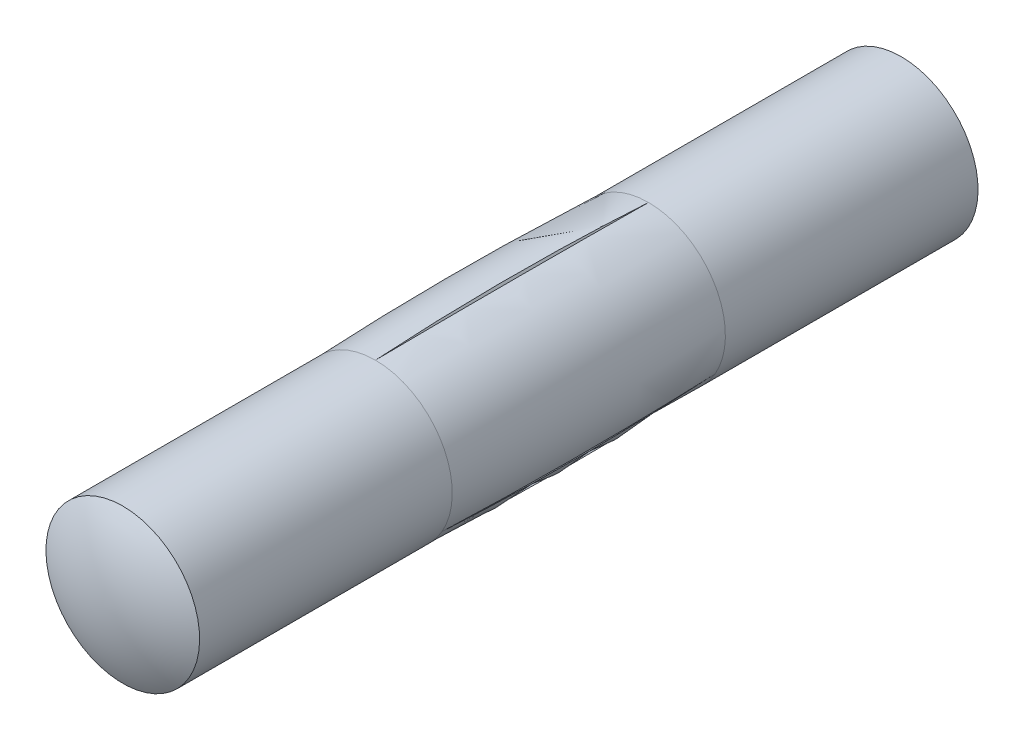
ISO-10303-21;
HEADER;
FILE_DESCRIPTION(('STEP AP214'),'2;1');
FILE_NAME('part.step','',(''),(''),'','','');
FILE_SCHEMA(('AUTOMOTIVE_DESIGN { 1 0 10303 214 1 1 1 1 }'));
ENDSEC;
DATA;
#1=APPLICATION_CONTEXT('core data for automotive mechanical design processes');
#2=APPLICATION_PROTOCOL_DEFINITION('international standard','automotive_design',2000,#1);
#3=PRODUCT_CONTEXT('',#1,'mechanical');
#4=PRODUCT('Part','Part','',(#3));
#5=PRODUCT_RELATED_PRODUCT_CATEGORY('part','',(#4));
#6=PRODUCT_DEFINITION_FORMATION('','',#4);
#7=PRODUCT_DEFINITION_CONTEXT('part definition',#1,'design');
#8=PRODUCT_DEFINITION('design','',#6,#7);
#9=PRODUCT_DEFINITION_SHAPE('','',#8);
#10=(LENGTH_UNIT() NAMED_UNIT(*) SI_UNIT(.MILLI.,.METRE.));
#11=(NAMED_UNIT(*) PLANE_ANGLE_UNIT() SI_UNIT($,.RADIAN.));
#12=(NAMED_UNIT(*) SI_UNIT($,.STERADIAN.) SOLID_ANGLE_UNIT());
#13=UNCERTAINTY_MEASURE_WITH_UNIT(LENGTH_MEASURE(1.E-05),#10,'distance_accuracy_value','');
#14=(GEOMETRIC_REPRESENTATION_CONTEXT(3) GLOBAL_UNCERTAINTY_ASSIGNED_CONTEXT((#13)) GLOBAL_UNIT_ASSIGNED_CONTEXT((#10,
#11,#12)) REPRESENTATION_CONTEXT('',''));
#15=CARTESIAN_POINT('',(0.,0.,0.));
#16=DIRECTION('',(0.,0.,1.));
#17=DIRECTION('',(1.,0.,0.));
#18=AXIS2_PLACEMENT_3D('',#15,#16,#17);
#19=CARTESIAN_POINT('',(0.,0.,12.9875));
#20=DIRECTION('',(-1.,0.,0.));
#21=DIRECTION('',(0.,0.,1.));
#22=AXIS2_PLACEMENT_3D('',#19,#20,#21);
#23=SPHERICAL_SURFACE('',#22,3.0125);
#24=CARTESIAN_POINT('',(0.,0.,12.9875));
#25=DIRECTION('',(0.,0.,1.));
#26=DIRECTION('',(0.,1.,0.));
#27=AXIS2_PLACEMENT_3D('',#24,#25,#26);
#28=SPHERICAL_SURFACE('',#27,3.0125);
#29=CARTESIAN_POINT('',(0.,0.,15.6));
#30=DIRECTION('',(0.,0.,1.));
#31=DIRECTION('',(0.,1.,0.));
#32=AXIS2_PLACEMENT_3D('',#29,#30,#31);
#33=CIRCLE('',#32,1.5);
#34=CARTESIAN_POINT('',(0.,1.5,15.6));
#35=VERTEX_POINT('',#34);
#36=EDGE_CURVE('E11',#35,#35,#33,.T.);
#37=ORIENTED_EDGE('',*,*,#36,.T.);
#38=EDGE_LOOP('',(#37));
#39=FACE_BOUND('',#38,.T.);
#40=ADVANCED_FACE('F17',(#39),#28,.T.);
#41=CARTESIAN_POINT('',(0.,0.,13.1333333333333));
#42=DIRECTION('',(0.,0.,-1.));
#43=DIRECTION('',(0.,1.,0.));
#44=AXIS2_PLACEMENT_3D('',#41,#42,#43);
#45=CYLINDRICAL_SURFACE('',#44,1.5);
#46=ORIENTED_EDGE('',*,*,#36,.F.);
#47=EDGE_LOOP('',(#46));
#48=FACE_BOUND('',#47,.T.);
#49=CARTESIAN_POINT('',(0.,0.,10.6666666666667));
#50=DIRECTION('',(0.,0.,1.));
#51=DIRECTION('',(0.,1.,0.));
#52=AXIS2_PLACEMENT_3D('',#49,#50,#51);
#53=CIRCLE('',#52,1.5);
#54=CARTESIAN_POINT('',(-1.29903810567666,-0.75,10.6666666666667));
#55=VERTEX_POINT('',#54);
#56=CARTESIAN_POINT('',(1.29903810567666,-0.75,10.6666666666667));
#57=VERTEX_POINT('',#56);
#58=EDGE_CURVE('E102',#55,#57,#53,.T.);
#59=ORIENTED_EDGE('',*,*,#58,.T.);
#60=CARTESIAN_POINT('',(0.,0.,10.6666666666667));
#61=DIRECTION('',(0.,0.,1.));
#62=DIRECTION('',(0.,1.,0.));
#63=AXIS2_PLACEMENT_3D('',#60,#61,#62);
#64=CIRCLE('',#63,1.5);
#65=CARTESIAN_POINT('',(0.,1.5,10.6666666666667));
#66=VERTEX_POINT('',#65);
#67=EDGE_CURVE('E157',#57,#66,#64,.T.);
#68=ORIENTED_EDGE('',*,*,#67,.T.);
#69=CARTESIAN_POINT('',(0.,0.,10.6666666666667));
#70=DIRECTION('',(0.,0.,1.));
#71=DIRECTION('',(0.,1.,0.));
#72=AXIS2_PLACEMENT_3D('',#69,#70,#71);
#73=CIRCLE('',#72,1.5);
#74=EDGE_CURVE('E55',#66,#55,#73,.T.);
#75=ORIENTED_EDGE('',*,*,#74,.T.);
#76=EDGE_LOOP('',(#59,#68,#75));
#77=FACE_BOUND('',#76,.T.);
#78=ADVANCED_FACE('F183',(#48,#77),#45,.T.);
#79=CARTESIAN_POINT('',(0.,0.,2.86666666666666));
#80=DIRECTION('',(0.,0.,-1.));
#81=DIRECTION('',(0.,1.,0.));
#82=AXIS2_PLACEMENT_3D('',#79,#80,#81);
#83=CYLINDRICAL_SURFACE('',#82,1.5);
#84=CARTESIAN_POINT('',(0.,0.,5.33333333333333));
#85=DIRECTION('',(0.,0.,1.));
#86=DIRECTION('',(0.,1.,0.));
#87=AXIS2_PLACEMENT_3D('',#84,#85,#86);
#88=CIRCLE('',#87,1.5);
#89=CARTESIAN_POINT('',(0.,1.5,5.33333333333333));
#90=VERTEX_POINT('',#89);
#91=CARTESIAN_POINT('',(-1.29903810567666,-0.75,5.3333333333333));
#92=VERTEX_POINT('',#91);
#93=EDGE_CURVE('E62',#90,#92,#88,.T.);
#94=ORIENTED_EDGE('',*,*,#93,.F.);
#95=CARTESIAN_POINT('',(0.,0.,5.33333333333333));
#96=DIRECTION('',(0.,0.,1.));
#97=DIRECTION('',(0.,1.,0.));
#98=AXIS2_PLACEMENT_3D('',#95,#96,#97);
#99=CIRCLE('',#98,1.5);
#100=CARTESIAN_POINT('',(1.29903810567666,-0.75,5.3333333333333));
#101=VERTEX_POINT('',#100);
#102=EDGE_CURVE('E95',#101,#90,#99,.T.);
#103=ORIENTED_EDGE('',*,*,#102,.F.);
#104=CARTESIAN_POINT('',(0.,0.,5.33333333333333));
#105=DIRECTION('',(0.,0.,1.));
#106=DIRECTION('',(0.,1.,0.));
#107=AXIS2_PLACEMENT_3D('',#104,#105,#106);
#108=CIRCLE('',#107,1.5);
#109=EDGE_CURVE('E89',#92,#101,#108,.T.);
#110=ORIENTED_EDGE('',*,*,#109,.F.);
#111=EDGE_LOOP('',(#94,#103,#110));
#112=FACE_BOUND('',#111,.T.);
#113=CARTESIAN_POINT('',(0.,0.,0.4));
#114=DIRECTION('',(0.,0.,1.));
#115=DIRECTION('',(0.,1.,0.));
#116=AXIS2_PLACEMENT_3D('',#113,#114,#115);
#117=CIRCLE('',#116,1.5);
#118=CARTESIAN_POINT('',(0.,1.5,0.4));
#119=VERTEX_POINT('',#118);
#120=EDGE_CURVE('E30',#119,#119,#117,.T.);
#121=ORIENTED_EDGE('',*,*,#120,.T.);
#122=EDGE_LOOP('',(#121));
#123=FACE_BOUND('',#122,.T.);
#124=ADVANCED_FACE('F92',(#112,#123),#83,.T.);
#125=CARTESIAN_POINT('',(0.,0.,3.0125));
#126=DIRECTION('',(-1.,0.,0.));
#127=DIRECTION('',(0.,0.,1.));
#128=AXIS2_PLACEMENT_3D('',#125,#126,#127);
#129=SPHERICAL_SURFACE('',#128,3.0125);
#130=CARTESIAN_POINT('',(0.,0.,3.0125));
#131=DIRECTION('',(0.,0.,1.));
#132=DIRECTION('',(0.,1.,0.));
#133=AXIS2_PLACEMENT_3D('',#130,#131,#132);
#134=SPHERICAL_SURFACE('',#133,3.0125);
#135=ORIENTED_EDGE('',*,*,#120,.F.);
#136=EDGE_LOOP('',(#135));
#137=FACE_BOUND('',#136,.T.);
#138=ADVANCED_FACE('F215',(#137),#134,.T.);
#139=CARTESIAN_POINT('',(0.86036465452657,2.72872806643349,8.4));
#140=DIRECTION('',(-0.819152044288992,0.573576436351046,0.));
#141=DIRECTION('',(0.,0.,1.));
#142=AXIS2_PLACEMENT_3D('',#139,#140,#141);
#143=PLANE('',#142);
#144=CARTESIAN_POINT('',(-6.89647088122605E-05,1.50000006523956,5.33333511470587));
#145=CARTESIAN_POINT('',(0.00559862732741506,1.50812433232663,5.54995931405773));
#146=CARTESIAN_POINT('',(0.0105847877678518,1.51523141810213,5.766639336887));
#147=CARTESIAN_POINT('',(0.0192447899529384,1.52754394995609,6.20370739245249));
#148=CARTESIAN_POINT('',(0.0228952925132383,1.53271560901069,6.42409684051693));
#149=CARTESIAN_POINT('',(0.0287913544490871,1.54108827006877,6.86856748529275));
#150=CARTESIAN_POINT('',(0.0310127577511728,1.54425537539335,7.09264964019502));
#151=CARTESIAN_POINT('',(0.0339980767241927,1.54853371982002,7.5444875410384));
#152=CARTESIAN_POINT('',(0.03473770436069,1.54961069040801,7.7722437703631));
#153=CARTESIAN_POINT('',(0.0347378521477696,1.54961068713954,8.22775052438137));
#154=CARTESIAN_POINT('',(0.0339984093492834,1.54853376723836,8.45550104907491));
#155=CARTESIAN_POINT('',(0.0310133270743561,1.54425560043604,8.90733134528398));
#156=CARTESIAN_POINT('',(0.0287919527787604,1.54108858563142,9.13141159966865));
#157=CARTESIAN_POINT('',(0.0228958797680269,1.5327160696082,9.57588224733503));
#158=CARTESIAN_POINT('',(0.0192453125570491,1.52754442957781,9.79627359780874));
#159=CARTESIAN_POINT('',(0.0105851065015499,1.51523179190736,10.2333492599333));
#160=CARTESIAN_POINT('',(0.00559878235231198,1.50812454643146,10.4500349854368));
#161=CARTESIAN_POINT('',(-6.8964708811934E-05,1.50000006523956,10.6666648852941));
#162=B_SPLINE_CURVE_WITH_KNOTS('',3,(#144,#145,#146,#147,#148,#149,#150,#151,#152,#153,#154,
#155,#156,#157,#158,#159,#160,#161),.UNSPECIFIED.,.F.,.F.,(4,2,2,2,2,2,2,2,4),(0.,
0.650548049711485,1.31197471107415,1.98430652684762,2.66757132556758,3.35081900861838,
4.02314511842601,4.68457748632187,5.33514265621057),.UNSPECIFIED.);
#163=EDGE_CURVE('E154',#90,#66,#162,.T.);
#164=ORIENTED_EDGE('',*,*,#163,.F.);
#165=DIRECTION('',(0.,0.,1.));
#166=VECTOR('',#165,1.);
#167=CARTESIAN_POINT('',(0.,1.5,0.4));
#168=LINE('',#167,#166);
#169=EDGE_CURVE('E76',#90,#66,#168,.T.);
#170=ORIENTED_EDGE('',*,*,#169,.T.);
#171=EDGE_LOOP('',(#164,#170));
#172=FACE_BOUND('',#171,.T.);
#173=ADVANCED_FACE('F181',(#172),#143,.T.);
#174=CARTESIAN_POINT('',(-0.860364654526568,2.72872806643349,8.4));
#175=DIRECTION('',(-0.819152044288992,-0.573576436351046,0.));
#176=DIRECTION('',(0.,0.,1.));
#177=AXIS2_PLACEMENT_3D('',#174,#175,#176);
#178=PLANE('',#177);
#179=CARTESIAN_POINT('',(6.89647088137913E-05,1.50000006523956,10.6666648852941));
#180=CARTESIAN_POINT('',(-0.00559862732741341,1.50812433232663,10.4500406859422));
#181=CARTESIAN_POINT('',(-0.0105847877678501,1.51523141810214,10.2333606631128));
#182=CARTESIAN_POINT('',(-0.0192447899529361,1.5275439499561,9.79629260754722));
#183=CARTESIAN_POINT('',(-0.022895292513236,1.53271560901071,9.57590315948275));
#184=CARTESIAN_POINT('',(-0.0287913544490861,1.54108827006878,9.13143251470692));
#185=CARTESIAN_POINT('',(-0.0310127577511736,1.54425537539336,8.90735035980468));
#186=CARTESIAN_POINT('',(-0.0339980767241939,1.54853371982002,8.45551245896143));
#187=CARTESIAN_POINT('',(-0.0347377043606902,1.54961069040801,8.22775622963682));
#188=CARTESIAN_POINT('',(-0.0347378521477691,1.54961068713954,7.77224947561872));
#189=CARTESIAN_POINT('',(-0.0339984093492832,1.54853376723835,7.54449895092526));
#190=CARTESIAN_POINT('',(-0.0310133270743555,1.54425560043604,7.09266865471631));
#191=CARTESIAN_POINT('',(-0.0287919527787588,1.54108858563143,6.86858840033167));
#192=CARTESIAN_POINT('',(-0.0228958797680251,1.53271606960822,6.42411775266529));
#193=CARTESIAN_POINT('',(-0.019245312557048,1.52754442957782,6.20372640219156));
#194=CARTESIAN_POINT('',(-0.0105851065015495,1.51523179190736,5.76665074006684));
#195=CARTESIAN_POINT('',(-0.00559878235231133,1.50812454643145,5.5499650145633));
#196=CARTESIAN_POINT('',(6.89647088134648E-05,1.50000006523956,5.33333511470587));
#197=B_SPLINE_CURVE_WITH_KNOTS('',3,(#179,#180,#181,#182,#183,#184,#185,#186,#187,#188,#189,
#190,#191,#192,#193,#194,#195,#196),.UNSPECIFIED.,.F.,.F.,(4,2,2,2,2,2,2,2,4),(0.,
0.650548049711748,1.3119747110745,1.98430652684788,2.66757132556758,3.35081900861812,
4.02314511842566,4.68457748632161,5.33514265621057),.UNSPECIFIED.);
#198=EDGE_CURVE('E70',#66,#90,#197,.T.);
#199=ORIENTED_EDGE('',*,*,#198,.F.);
#200=ORIENTED_EDGE('',*,*,#169,.F.);
#201=EDGE_LOOP('',(#199,#200));
#202=FACE_BOUND('',#201,.T.);
#203=ADVANCED_FACE('F19',(#202),#178,.F.);
#204=CARTESIAN_POINT('',(0.,0.,8.));
#205=DIRECTION('',(0.,0.,1.));
#206=DIRECTION('',(-1.,0.,0.));
#207=AXIS2_PLACEMENT_3D('',#204,#205,#206);
#208=DEGENERATE_TOROIDAL_SURFACE('',#207,69.5861111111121,71.1361111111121,.F.);
#209=CARTESIAN_POINT('',(-1.29900367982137,-0.750059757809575,5.33333511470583));
#210=CARTESIAN_POINT('',(-1.30887329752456,-0.749213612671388,5.54995931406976));
#211=CARTESIAN_POINT('',(-1.31752129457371,-0.748449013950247,5.76663933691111));
#212=CARTESIAN_POINT('',(-1.3325142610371,-0.747105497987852,6.2037073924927));
#213=CARTESIAN_POINT('',(-1.33881830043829,-0.74652989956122,6.42409684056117));
#214=CARTESIAN_POINT('',(-1.34901726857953,-0.745610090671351,6.868567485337));
#215=CARTESIAN_POINT('',(-1.35287076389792,-0.745269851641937,7.09264964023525));
#216=CARTESIAN_POINT('',(-1.35806857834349,-0.744823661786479,7.54448754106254));
#217=CARTESIAN_POINT('',(-1.35937107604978,-0.744721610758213,7.77224377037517));
#218=CARTESIAN_POINT('',(-1.35937114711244,-0.744721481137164,8.22775052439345));
#219=CARTESIAN_POINT('',(-1.35806878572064,-0.744823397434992,8.45550104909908));
#220=CARTESIAN_POINT('',(-1.35287124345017,-0.745269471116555,8.90733134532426));
#221=CARTESIAN_POINT('',(-1.34901784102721,-0.745609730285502,9.13141159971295));
#222=CARTESIAN_POINT('',(-1.33881899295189,-0.746529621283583,9.57588224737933));
#223=CARTESIAN_POINT('',(-1.33251493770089,-0.747105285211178,9.79627359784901));
#224=CARTESIAN_POINT('',(-1.31752177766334,-0.748448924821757,10.2333492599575));
#225=CARTESIAN_POINT('',(-1.30887356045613,-0.749213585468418,10.4500349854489));
#226=CARTESIAN_POINT('',(-1.29900367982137,-0.750059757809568,10.6666648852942));
#227=B_SPLINE_CURVE_WITH_KNOTS('',3,(#209,#210,#211,#212,#213,#214,#215,#216,#217,#218,#219,
#220,#221,#222,#223,#224,#225,#226),.UNSPECIFIED.,.F.,.F.,(4,2,2,2,2,2,2,2,4),(0.,
0.65054804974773,1.31197471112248,1.98430652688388,2.66757132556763,3.35081900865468,
4.0231451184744,4.68457748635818,5.33514265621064),.UNSPECIFIED.);
#228=EDGE_CURVE('E66',#92,#55,#227,.T.);
#229=ORIENTED_EDGE('',*,*,#228,.T.);
#230=ORIENTED_EDGE('',*,*,#74,.F.);
#231=ORIENTED_EDGE('',*,*,#198,.T.);
#232=ORIENTED_EDGE('',*,*,#93,.T.);
#233=EDGE_LOOP('',(#229,#230,#231,#232));
#234=FACE_BOUND('',#233,.T.);
#235=ADVANCED_FACE('F64',(#234),#208,.F.);
#236=CARTESIAN_POINT('',(-1.9329654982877,-2.10946168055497,8.4));
#237=DIRECTION('',(0.90630778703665,-0.4226182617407,0.));
#238=DIRECTION('',(0.,0.,1.));
#239=AXIS2_PLACEMENT_3D('',#236,#237,#238);
#240=PLANE('',#239);
#241=CARTESIAN_POINT('',(-1.29907264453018,-0.749940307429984,10.6666648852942));
#242=CARTESIAN_POINT('',(-1.30327467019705,-0.758910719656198,10.4500406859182));
#243=CARTESIAN_POINT('',(-1.30693650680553,-0.766782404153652,10.2333606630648));
#244=CARTESIAN_POINT('',(-1.31326947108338,-0.780438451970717,9.79629260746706));
#245=CARTESIAN_POINT('',(-1.31592300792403,-0.78618570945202,9.57590315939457));
#246=CARTESIAN_POINT('',(-1.32022591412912,-0.795478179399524,9.13143251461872));
#247=CARTESIAN_POINT('',(-1.32185800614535,-0.798985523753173,8.90735035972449));
#248=CARTESIAN_POINT('',(-1.32407050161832,-0.803710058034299,8.45551245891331));
#249=CARTESIAN_POINT('',(-1.32463337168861,-0.804889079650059,8.22775622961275));
#250=CARTESIAN_POINT('',(-1.32463329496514,-0.804889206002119,7.77224947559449));
#251=CARTESIAN_POINT('',(-1.32407037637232,-0.803710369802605,7.54449895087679));
#252=CARTESIAN_POINT('',(-1.32185791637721,-0.798986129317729,7.09266865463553));
#253=CARTESIAN_POINT('',(-1.32022588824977,-0.795478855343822,6.86858840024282));
#254=CARTESIAN_POINT('',(-1.31592311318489,-0.786186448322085,6.42411775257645));
#255=CARTESIAN_POINT('',(-1.31326962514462,-0.780439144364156,6.20372640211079));
#256=CARTESIAN_POINT('',(-1.30693667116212,-0.766782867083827,5.76665074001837));
#257=CARTESIAN_POINT('',(-1.30327477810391,-0.758910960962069,5.54996501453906));
#258=CARTESIAN_POINT('',(-1.29907264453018,-0.749940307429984,5.33333511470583));
#259=B_SPLINE_CURVE_WITH_KNOTS('',3,(#241,#242,#243,#244,#245,#246,#247,#248,#249,#250,#251,
#252,#253,#254,#255,#256,#257,#258),.UNSPECIFIED.,.F.,.F.,(4,2,2,2,2,2,2,2,4),(0.,
0.650548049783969,1.3119747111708,1.98430652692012,2.66757132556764,3.35081900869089,
4.02314511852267,4.68457748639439,5.33514265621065),.UNSPECIFIED.);
#260=EDGE_CURVE('E82',#55,#92,#259,.T.);
#261=ORIENTED_EDGE('',*,*,#260,.F.);
#262=DIRECTION('',(0.,0.,1.));
#263=VECTOR('',#262,1.);
#264=CARTESIAN_POINT('',(-1.29903810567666,-0.75,0.4));
#265=LINE('',#264,#263);
#266=EDGE_CURVE('E79',#92,#55,#265,.T.);
#267=ORIENTED_EDGE('',*,*,#266,.F.);
#268=EDGE_LOOP('',(#261,#267));
#269=FACE_BOUND('',#268,.T.);
#270=ADVANCED_FACE('F80',(#269),#240,.F.);
#271=CARTESIAN_POINT('',(-2.79333015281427,-0.619266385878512,8.4));
#272=DIRECTION('',(-0.0871557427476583,-0.996194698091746,0.));
#273=DIRECTION('',(0.,0.,1.));
#274=AXIS2_PLACEMENT_3D('',#271,#272,#273);
#275=PLANE('',#274);
#276=ORIENTED_EDGE('',*,*,#228,.F.);
#277=ORIENTED_EDGE('',*,*,#266,.T.);
#278=EDGE_LOOP('',(#276,#277));
#279=FACE_BOUND('',#278,.T.);
#280=ADVANCED_FACE('F88',(#279),#275,.T.);
#281=CARTESIAN_POINT('',(0.,0.,8.));
#282=DIRECTION('',(0.,0.,1.));
#283=DIRECTION('',(-1.,0.,0.));
#284=AXIS2_PLACEMENT_3D('',#281,#282,#283);
#285=DEGENERATE_TOROIDAL_SURFACE('',#284,69.5861111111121,71.1361111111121,.F.);
#286=CARTESIAN_POINT('',(1.29907264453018,-0.749940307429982,5.33333511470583));
#287=CARTESIAN_POINT('',(1.3032746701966,-0.758910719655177,5.5499593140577));
#288=CARTESIAN_POINT('',(1.30693650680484,-0.766782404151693,5.76663933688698));
#289=CARTESIAN_POINT('',(1.31326947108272,-0.780438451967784,6.20370739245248));
#290=CARTESIAN_POINT('',(1.31592300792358,-0.786185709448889,6.42409684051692));
#291=CARTESIAN_POINT('',(1.32022591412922,-0.795478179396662,6.86856748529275));
#292=CARTESIAN_POINT('',(1.32185800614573,-0.798985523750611,7.09264964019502));
#293=CARTESIAN_POINT('',(1.32407050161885,-0.803710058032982,7.5444875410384));
#294=CARTESIAN_POINT('',(1.32463337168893,-0.804889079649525,7.7722437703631));
#295=CARTESIAN_POINT('',(1.32463329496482,-0.804889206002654,8.22775052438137));
#296=CARTESIAN_POINT('',(1.32407037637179,-0.803710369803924,8.45550104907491));
#297=CARTESIAN_POINT('',(1.32185791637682,-0.798986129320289,8.90733134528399));
#298=CARTESIAN_POINT('',(1.32022588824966,-0.795478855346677,9.13141159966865));
#299=CARTESIAN_POINT('',(1.31592311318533,-0.786186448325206,9.57588224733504));
#300=CARTESIAN_POINT('',(1.31326962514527,-0.780439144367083,9.79627359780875));
#301=CARTESIAN_POINT('',(1.30693667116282,-0.766782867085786,10.2333492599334));
#302=CARTESIAN_POINT('',(1.30327477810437,-0.758910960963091,10.4500349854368));
#303=CARTESIAN_POINT('',(1.29907264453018,-0.749940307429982,10.6666648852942));
#304=B_SPLINE_CURVE_WITH_KNOTS('',3,(#286,#287,#288,#289,#290,#291,#292,#293,#294,#295,#296,
#297,#298,#299,#300,#301,#302,#303),.UNSPECIFIED.,.F.,.F.,(4,2,2,2,2,2,2,2,4),(0.,
0.650548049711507,1.31197471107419,1.98430652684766,2.66757132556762,3.35081900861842,
4.02314511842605,4.68457748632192,5.33514265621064),.UNSPECIFIED.);
#305=EDGE_CURVE('E138',#101,#57,#304,.T.);
#306=ORIENTED_EDGE('',*,*,#305,.T.);
#307=ORIENTED_EDGE('',*,*,#58,.F.);
#308=ORIENTED_EDGE('',*,*,#260,.T.);
#309=ORIENTED_EDGE('',*,*,#109,.T.);
#310=EDGE_LOOP('',(#306,#307,#308,#309));
#311=FACE_BOUND('',#310,.T.);
#312=ADVANCED_FACE('F101',(#311),#285,.F.);
#313=CARTESIAN_POINT('',(0.,0.,8.));
#314=DIRECTION('',(0.,0.,1.));
#315=DIRECTION('',(-1.,0.,0.));
#316=AXIS2_PLACEMENT_3D('',#313,#314,#315);
#317=DEGENERATE_TOROIDAL_SURFACE('',#316,69.5861111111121,71.1361111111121,.F.);
#318=CARTESIAN_POINT('',(1.29900367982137,-0.750059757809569,10.6666648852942));
#319=CARTESIAN_POINT('',(1.30887329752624,-0.749213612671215,10.450040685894));
#320=CARTESIAN_POINT('',(1.31752129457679,-0.74844901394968,10.2333606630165));
#321=CARTESIAN_POINT('',(1.3325142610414,-0.747105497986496,9.79629260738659));
#322=CARTESIAN_POINT('',(1.33881830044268,-0.746529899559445,9.57590315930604));
#323=CARTESIAN_POINT('',(1.34901726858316,-0.745610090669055,9.13143251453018));
#324=CARTESIAN_POINT('',(1.35287076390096,-0.745269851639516,8.907350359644));
#325=CARTESIAN_POINT('',(1.35806857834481,-0.7448236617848,8.45551245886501));
#326=CARTESIAN_POINT('',(1.35937107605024,-0.74472161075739,8.2277562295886));
#327=CARTESIAN_POINT('',(1.35937114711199,-0.744721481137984,7.77224947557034));
#328=CARTESIAN_POINT('',(1.35806878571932,-0.744823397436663,7.54449895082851));
#329=CARTESIAN_POINT('',(1.35287124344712,-0.745269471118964,7.09266865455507));
#330=CARTESIAN_POINT('',(1.34901784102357,-0.745609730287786,6.86858840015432));
#331=CARTESIAN_POINT('',(1.3388189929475,-0.746529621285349,6.42411775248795));
#332=CARTESIAN_POINT('',(1.3325149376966,-0.747105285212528,6.20372640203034));
#333=CARTESIAN_POINT('',(1.31752177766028,-0.748448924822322,5.76665073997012));
#334=CARTESIAN_POINT('',(1.30887356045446,-0.74921358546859,5.54996501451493));
#335=CARTESIAN_POINT('',(1.29900367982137,-0.750059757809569,5.33333511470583));
#336=B_SPLINE_CURVE_WITH_KNOTS('',3,(#318,#319,#320,#321,#322,#323,#324,#325,#326,#327,#328,
#329,#330,#331,#332,#333,#334,#335),.UNSPECIFIED.,.F.,.F.,(4,2,2,2,2,2,2,2,4),(0.,
0.650548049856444,1.31197471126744,1.9843065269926,2.66757132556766,3.35081900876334,
4.02314511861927,4.68457748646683,5.33514265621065),.UNSPECIFIED.);
#337=EDGE_CURVE('E142',#57,#101,#336,.T.);
#338=ORIENTED_EDGE('',*,*,#337,.T.);
#339=ORIENTED_EDGE('',*,*,#102,.T.);
#340=ORIENTED_EDGE('',*,*,#163,.T.);
#341=ORIENTED_EDGE('',*,*,#67,.F.);
#342=EDGE_LOOP('',(#338,#339,#340,#341));
#343=FACE_BOUND('',#342,.T.);
#344=ADVANCED_FACE('F120',(#343),#317,.F.);
#345=CARTESIAN_POINT('',(2.79333015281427,-0.619266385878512,8.4));
#346=DIRECTION('',(-0.0871557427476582,0.996194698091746,0.));
#347=DIRECTION('',(0.,0.,1.));
#348=AXIS2_PLACEMENT_3D('',#345,#346,#347);
#349=PLANE('',#348);
#350=ORIENTED_EDGE('',*,*,#337,.F.);
#351=DIRECTION('',(0.,0.,1.));
#352=VECTOR('',#351,1.);
#353=CARTESIAN_POINT('',(1.29903810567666,-0.75,0.4));
#354=LINE('',#353,#352);
#355=EDGE_CURVE('E141',#101,#57,#354,.T.);
#356=ORIENTED_EDGE('',*,*,#355,.F.);
#357=EDGE_LOOP('',(#350,#356));
#358=FACE_BOUND('',#357,.T.);
#359=ADVANCED_FACE('F230',(#358),#349,.F.);
#360=CARTESIAN_POINT('',(1.9329654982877,-2.10946168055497,8.4));
#361=DIRECTION('',(0.90630778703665,0.422618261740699,0.));
#362=DIRECTION('',(0.,0.,1.));
#363=AXIS2_PLACEMENT_3D('',#360,#361,#362);
#364=PLANE('',#363);
#365=ORIENTED_EDGE('',*,*,#305,.F.);
#366=ORIENTED_EDGE('',*,*,#355,.T.);
#367=EDGE_LOOP('',(#365,#366));
#368=FACE_BOUND('',#367,.T.);
#369=ADVANCED_FACE('F139',(#368),#364,.T.);
#370=CLOSED_SHELL('',(#40,#78,#124,#138,#173,#203,#235,#270,#280,#312,#344,#359,#369));
#371=MANIFOLD_SOLID_BREP('B1',#370);
#372=ADVANCED_BREP_SHAPE_REPRESENTATION('',(#18,#371),#14);
#373=SHAPE_DEFINITION_REPRESENTATION(#9,#372);
ENDSEC;
END-ISO-10303-21;
